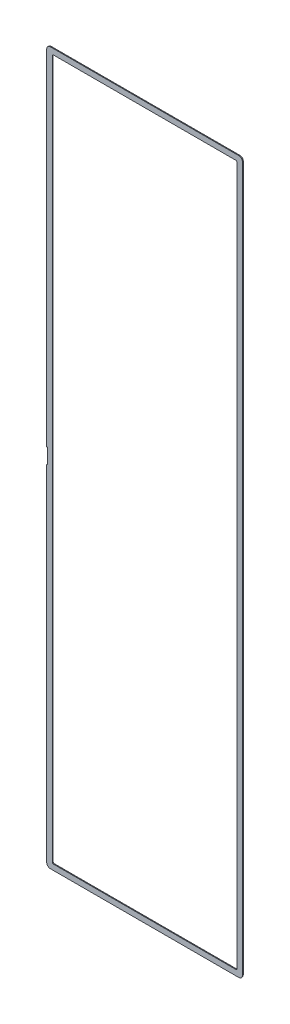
from build123d import *

# Parameters (mm, degrees)
SKETCH_1_W          = 501
SKETCH_1_H          = 1901
EXTRUDE_1_DEPTH     = 4
FILLET_1_R          = 3
SKETCH_2_W          = 4.326600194
SKETCH_2_H          = 41
CUT_EXTRUDE_1_DEPTH = 1002.347342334


with BuildPart() as part:
    # Sketch 1 → Extrude 1 (new body)
    with BuildSketch(Plane.XY):
        with BuildLine():
            Line((-255.5, -965.5), (255.5, -965.5))
            ThreePointArc((255.5, -965.5), (262.571067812, -962.571067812), (265.5, -955.5))
            Line((265.5, -955.5), (265.5, 955.5))
            ThreePointArc((265.5, 955.5), (262.571067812, 962.571067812), (255.5, 965.5))
            Line((255.5, 965.5), (-255.5, 965.5))
            ThreePointArc((-255.5, 965.5), (-262.571067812, 962.571067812), (-265.5, 955.5))
            Line((-265.5, 955.5), (-265.5, -955.5))
            ThreePointArc((-265.5, -955.5), (-262.571067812, -962.571067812), (-255.5, -965.5))
        make_face()
        Rectangle(SKETCH_1_W, SKETCH_1_H, mode=Mode.SUBTRACT)
    extrude(amount=EXTRUDE_1_DEPTH)

    # Fillet 1
    fillet_1_edges = [part.edges().sort_by_distance(p)[0] for p in [
        (0, -965.5, 0),
        (-262.571067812, -962.571067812, 0),
        (0, -950.5, 0),
        (-250.5, -950.5, 2),
        (250.5, 0, 0),
        (250.5, -950.5, 2),
        (0, 950.5, 0),
        (250.5, 950.5, 2),
        (-250.5, 0, 0),
        (-250.5, 950.5, 2),
        (-265.5, 0, 0),
        (-262.571067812, 962.571067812, 0),
        (0, 965.5, 0),
        (262.571067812, 962.571067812, 0),
        (265.5, 0, 0),
        (262.571067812, -962.571067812, 0),
    ]]
    fillet(fillet_1_edges, radius=FILLET_1_R)

    # Sketch 2 → Cut-Extrude 1 (cut, through all)
    with BuildSketch(Plane.XY.offset(4)):
        with Locations((-265.336699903, 0)):
            Rectangle(SKETCH_2_W, SKETCH_2_H)
    extrude(amount=-CUT_EXTRUDE_1_DEPTH, mode=Mode.SUBTRACT)


solid = part.part
